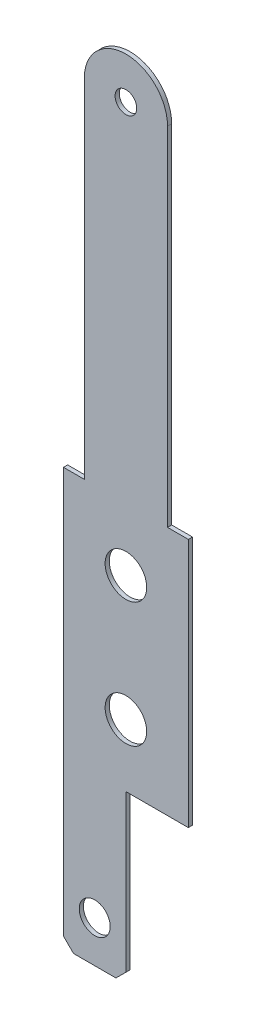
from build123d import *

# Parameters (mm, degrees)
BOSS_EXTRUDE1_DEPTH     = 0.3175
SKETCH2_R               = 1.5875
CUT_EXTRUDE1_DEPTH      = 68.952697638
SKETCH3_R               = 1.5875
CUT_EXTRUDE2_DEPTH      = 68.952697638
SKETCH4_R               = 0.8255
CUT_EXTRUDE3_DEPTH      = 68.952697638
SKETCH5_W               = 4.7625
SKETCH5_H               = 12.7
SKETCH5_R               = 1.1811
BOSS_EXTRUDE2_DEPTH     = 0.3175
CHAMFER1_SIZE           = 0.762
CUT_EXTRUDE4_DEPTH      = 68.952697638
CUT_EXTRUDE4_DEPTH_BACK = 68.952697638


with BuildPart() as part:
    # Sketch1 → Boss-Extrude1 (new body)
    with BuildSketch(Plane.XY):
        with BuildLine():
            Line((-4.7625, 52.451), (-4.7625, 0))
            Line((-4.7625, 0), (4.7625, 0))
            Line((4.7625, 0), (4.7625, 52.451))
            ThreePointArc((4.7625, 52.451), (0, 67.448671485), (-4.7625, 52.451))
        make_face()
    extrude(amount=BOSS_EXTRUDE1_DEPTH)

    # Sketch2 → Cut-Extrude1 (cut, through all)
    with BuildSketch(Plane.XY.offset(0.3175)):
        with Locations((0, 59.193671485)):
            Circle(SKETCH2_R)
    extrude(amount=-CUT_EXTRUDE1_DEPTH, mode=Mode.SUBTRACT)

    # Sketch3 → Cut-Extrude2 (cut, through all)
    with BuildSketch(Plane.XY.offset(0.3175)):
        with Locations((0, 4.7625)):
            Circle(SKETCH3_R)
        with Locations((0, 14.2875)):
            Circle(SKETCH3_R)
    extrude(amount=-CUT_EXTRUDE2_DEPTH, mode=Mode.SUBTRACT)

    # Sketch4 → Cut-Extrude3 (cut, through all)
    with BuildSketch(Plane.XY.offset(0.3175)):
        with Locations((0, 45.5676)):
            Circle(SKETCH4_R)
    extrude(amount=-CUT_EXTRUDE3_DEPTH, mode=Mode.SUBTRACT)

    # Sketch5 → Boss-Extrude2 (add, through all)
    with BuildSketch(Plane.XY.offset(0.3175)):
        with Locations((-2.38125, -6.35)):
            Rectangle(SKETCH5_W, SKETCH5_H)
        with Locations((-2.38125, -9.525)):
            Circle(SKETCH5_R, mode=Mode.SUBTRACT)
    extrude(amount=-BOSS_EXTRUDE2_DEPTH)

    # Chamfer1
    chamfer1_edges = [part.edges().sort_by_distance(p)[0] for p in [
        (-4.7625, -12.7, 0.15875),
        (0, -12.7, 0.15875),
    ]]
    chamfer(chamfer1_edges, length=CHAMFER1_SIZE)

    # Sketch6 → Cut-Extrude4 (cut, two sides: drawn at the far end of the back side and taken through both)
    with BuildSketch(Plane.XY.offset(0.3175).offset(-CUT_EXTRUDE4_DEPTH_BACK)):
        with BuildLine():
            Line((-114.999952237, 19.05), (-4.7625, 19.05))
            Line((-4.7625, 19.05), (-3.175, 19.05))
            Line((-3.175, 19.05), (-3.175, 45.5676))
            ThreePointArc((-3.175, 45.5676), (0, 48.7426), (3.175, 45.5676))
            Line((3.175, 45.5676), (3.175, 19.05))
            Line((3.175, 19.05), (4.7625, 19.05))
            Line((4.7625, 19.05), (114.999952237, 19.05))
            Line((114.999952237, 19.05), (114.999952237, 239.524904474))
            Line((114.999952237, 239.524904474), (-114.999952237, 239.524904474))
            Line((-114.999952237, 239.524904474), (-114.999952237, 19.05))
        make_face()
    extrude(amount=CUT_EXTRUDE4_DEPTH + CUT_EXTRUDE4_DEPTH_BACK, mode=Mode.SUBTRACT)


solid = part.part
